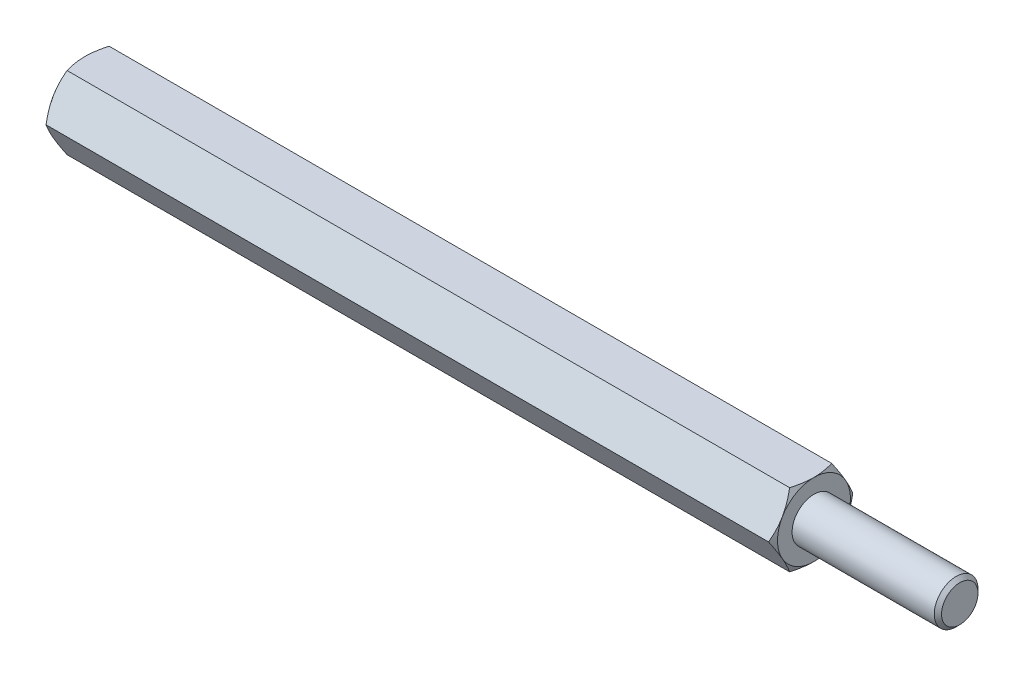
from build123d import *

# Parameters (mm, degrees)
EXTRUDE2_DEPTH = 25
SKETCH3_R      = 1.25
EXTRUDE3_DEPTH = 10
SKETCH5_R      = 1.5
EXTRUDE4_DEPTH = 10
CHAMFER1_SIZE  = 0.25


with BuildPart() as part:
    # Sketch1 → Extrude2 (new, symmetric)
    with BuildSketch(Plane(origin=(0, 0, 0), x_dir=(0, 0, -1), z_dir=(1, 0, 0))):
        Polygon((1.443375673, 2.5), (-1.443375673, 2.5), (-2.886751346, 0), (-1.443375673, -2.5), (1.443375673, -2.5), (2.886751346, 0), align=None)
    extrude(amount=EXTRUDE2_DEPTH, both=True)

    # Sketch2 → Cut-Revolve1 (revolve, cut)
    with BuildSketch(Plane.XY):
        with BuildLine():
            Line((-25, 2.5), (-23.5, 5.098076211))
            ThreePointArc((-23.5, 5.098076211), (-23.98810136, 6.276457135), (-25, 5.5))
            Line((-25, 5.5), (-25, 2.5))
        make_face()
    cut_revolve1 = revolve(axis=Axis((0, 0, 0), (1, 0, 0)), mode=Mode.SUBTRACT)

    # Mirror1: Cut-Revolve1 across plane
    add(cut_revolve1.mirror(Plane(origin=(0, 0, 0), x_dir=(0, 0, 1), z_dir=(1, 0, 0))), mode=Mode.SUBTRACT)

    # Sketch3 → Extrude3 (cut)
    with BuildSketch(Plane.ZY.offset(25)):
        Circle(SKETCH3_R)
    extrude(amount=-EXTRUDE3_DEPTH, mode=Mode.SUBTRACT)

    # Sketch4 → Cut-Revolve2 (revolve, cut)
    with BuildSketch(Plane.XY, mode=Mode.PRIVATE) as cut_revolve2_sk:
        Polygon((-15, 0), (-15, 1.25), (-14.278312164, 0), align=None)
    revolve(cut_revolve2_sk.sketch.rotate(Axis((-14.278312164, 0, 0), (-1, 0, 0)), 270), axis=Axis((-14.278312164, 0, 0), (-1, 0, 0)), mode=Mode.SUBTRACT)

    # Sketch5 → Extrude4 (add)
    with BuildSketch(Plane(origin=(25, 0, 0), x_dir=(0, 0, -1), z_dir=(1, 0, 0))):
        Circle(SKETCH5_R)
    extrude(amount=EXTRUDE4_DEPTH)

    # Chamfer1
    chamfer1_edges = [part.edges().sort_by_distance(p)[0] for p in [
        (35, 0, 1.5),
    ]]
    chamfer(chamfer1_edges, length=CHAMFER1_SIZE)


solid = part.part
